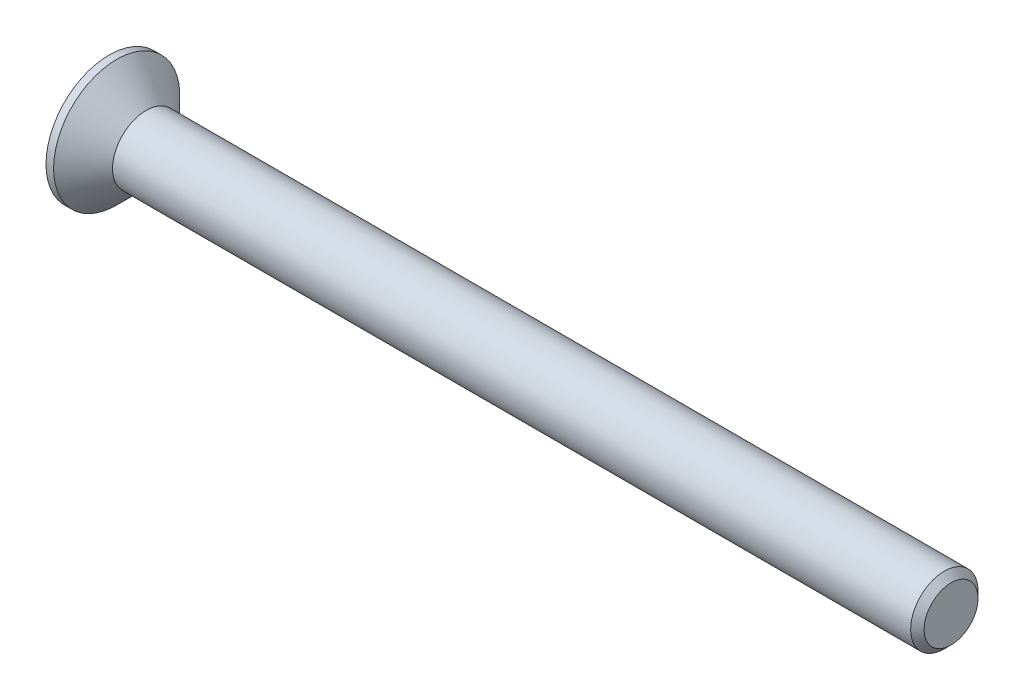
from build123d import *

# Parameters (mm, degrees)
CHAMFER1_SIZE      = 0.4
CUT_EXTRUDE1_DEPTH = 1.9


with BuildPart() as part:
    # Sketch1 → Revolve1 (revolve)
    with BuildSketch(Plane.XY, mode=Mode.PRIVATE) as revolve1_sk:
        Polygon((-2.2, 3.75), (-2.2, 0), (47.8, 0), (47.8, 2), (0, 2), (-1.75, 3.75), align=None)
    revolve(revolve1_sk.sketch.rotate(Axis((-2.2, 0, 0), (1, 0, 0)), 90), axis=Axis((-2.2, 0, 0), (1, 0, 0)))

    # Chamfer1
    chamfer1_edges = [part.edges().sort_by_distance(p)[0] for p in [
        (47.8, 0, -2),
    ]]
    chamfer(chamfer1_edges, length=CHAMFER1_SIZE)

    # Sketch2 → Cut-Extrude1 (cut)
    with BuildSketch(Plane.ZY.offset(2.2)):
        Polygon((-0.55, 2.2), (0.55, 2.2), (0.55, 0.55), (2.2, 0.55), (2.2, -0.55), (0.55, -0.55), (0.55, -2.2), (-0.55, -2.2), (-0.55, -0.55), (-2.2, -0.55), (-2.2, 0.55), (-0.55, 0.55), align=None)
    extrude(amount=-CUT_EXTRUDE1_DEPTH, mode=Mode.SUBTRACT)


solid = part.part
